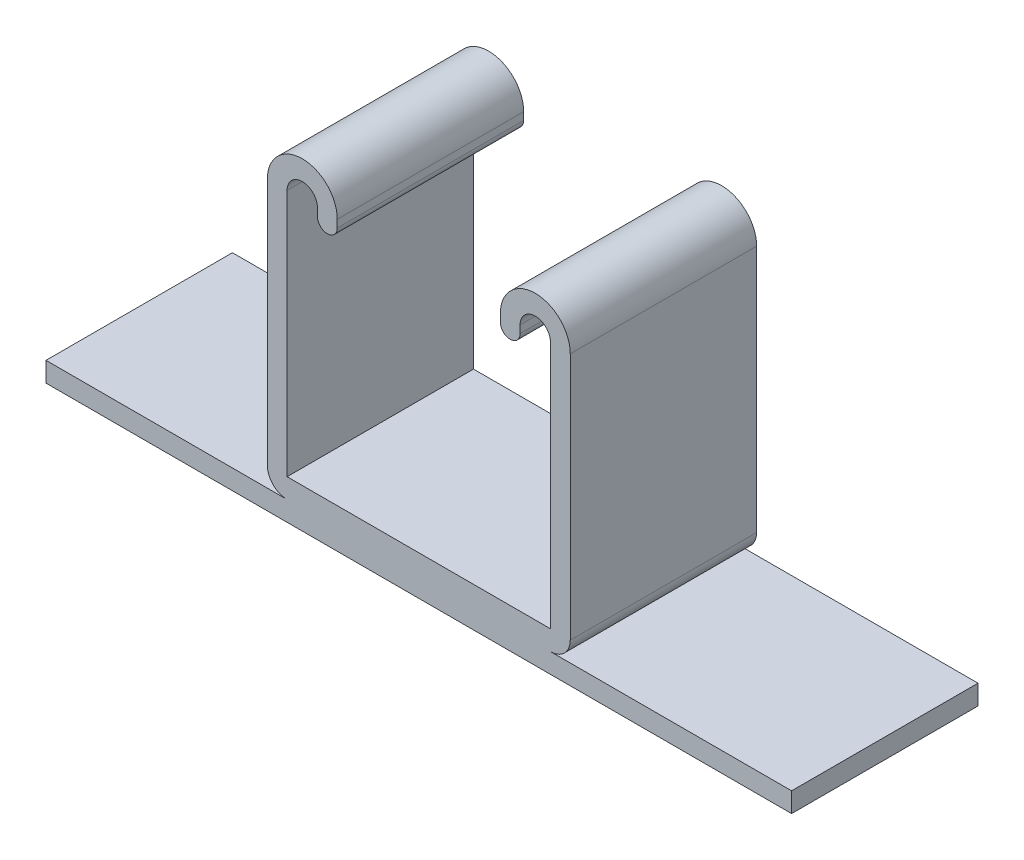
from build123d import *

# Parameters (mm, degrees)
BASE_EXTRUDE_DEPTH = 12.7


with BuildPart() as part:
    # Sketch1 → Base-Extrude (new, symmetric)
    with BuildSketch(Plane.XY):
        with BuildLine():
            Line((-20.6375, 26.8351), (-20.6375, -6.9596))
            ThreePointArc((-20.6375, -6.9596), (-19.848914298, -8.863414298), (-17.9451, -9.652))
            Line((-17.9451, -9.652), (-50.8, -9.652))
            Line((-50.8, -9.652), (-50.8, -12.3444))
            Line((-50.8, -12.3444), (50.8, -12.3444))
            Line((50.8, -12.3444), (50.8, -9.652))
            Line((50.8, -9.652), (17.9451, -9.652))
            ThreePointArc((17.9451, -9.652), (19.848914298, -8.863414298), (20.6375, -6.9596))
            Line((20.6375, -6.9596), (20.6375, 26.8351))
            ThreePointArc((20.6375, 26.8351), (15.875, 31.5976), (11.1125, 26.8351))
            Line((11.1125, 26.8351), (11.1125, 25.80005))
            ThreePointArc((11.1125, 25.80005), (12.4587, 24.45385), (13.8049, 25.80005))
            Line((13.8049, 25.80005), (13.8049, 26.8351))
            ThreePointArc((13.8049, 26.8351), (15.875, 28.9052), (17.9451, 26.8351))
            Line((17.9451, 26.8351), (17.9451, -6.9596))
            Line((17.9451, -6.9596), (-17.9451, -6.9596))
            Line((-17.9451, -6.9596), (-17.9451, 26.8351))
            ThreePointArc((-17.9451, 26.8351), (-15.875, 28.9052), (-13.8049, 26.8351))
            Line((-13.8049, 26.8351), (-13.8049, 25.80005))
            ThreePointArc((-13.8049, 25.80005), (-12.4587, 24.45385), (-11.1125, 25.80005))
            Line((-11.1125, 25.80005), (-11.1125, 26.8351))
            ThreePointArc((-11.1125, 26.8351), (-15.875, 31.5976), (-20.6375, 26.8351))
        make_face()
    extrude(amount=BASE_EXTRUDE_DEPTH, both=True)


solid = part.part
